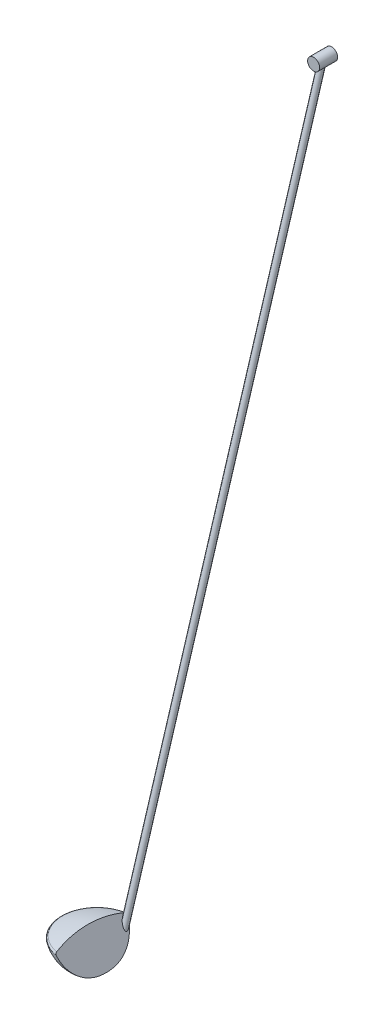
ISO-10303-21;
HEADER;
FILE_DESCRIPTION(('STEP AP214'),'2;1');
FILE_NAME('part.step','',(''),(''),'','','');
FILE_SCHEMA(('AUTOMOTIVE_DESIGN { 1 0 10303 214 1 1 1 1 }'));
ENDSEC;
DATA;
#1=APPLICATION_CONTEXT('core data for automotive mechanical design processes');
#2=APPLICATION_PROTOCOL_DEFINITION('international standard','automotive_design',2000,#1);
#3=PRODUCT_CONTEXT('',#1,'mechanical');
#4=PRODUCT('Part','Part','',(#3));
#5=PRODUCT_RELATED_PRODUCT_CATEGORY('part','',(#4));
#6=PRODUCT_DEFINITION_FORMATION('','',#4);
#7=PRODUCT_DEFINITION_CONTEXT('part definition',#1,'design');
#8=PRODUCT_DEFINITION('design','',#6,#7);
#9=PRODUCT_DEFINITION_SHAPE('','',#8);
#10=(LENGTH_UNIT() NAMED_UNIT(*) SI_UNIT(.MILLI.,.METRE.));
#11=(NAMED_UNIT(*) PLANE_ANGLE_UNIT() SI_UNIT($,.RADIAN.));
#12=(NAMED_UNIT(*) SI_UNIT($,.STERADIAN.) SOLID_ANGLE_UNIT());
#13=UNCERTAINTY_MEASURE_WITH_UNIT(LENGTH_MEASURE(1.E-05),#10,'distance_accuracy_value','');
#14=(GEOMETRIC_REPRESENTATION_CONTEXT(3) GLOBAL_UNCERTAINTY_ASSIGNED_CONTEXT((#13)) GLOBAL_UNIT_ASSIGNED_CONTEXT((#10,
#11,#12)) REPRESENTATION_CONTEXT('',''));
#15=CARTESIAN_POINT('',(0.,0.,0.));
#16=DIRECTION('',(0.,0.,1.));
#17=DIRECTION('',(1.,0.,0.));
#18=AXIS2_PLACEMENT_3D('',#15,#16,#17);
#19=CARTESIAN_POINT('',(-5.,1118.42336475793,-380.830138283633));
#20=DIRECTION('',(0.,0.956952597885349,-0.290244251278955));
#21=DIRECTION('',(0.,0.290244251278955,0.956952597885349));
#22=AXIS2_PLACEMENT_3D('',#19,#20,#21);
#23=CYLINDRICAL_SURFACE('',#22,5.00000000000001);
#24=CARTESIAN_POINT('',(-7.41467266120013,42.3527441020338,-59.0325591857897));
#25=CARTESIAN_POINT('',(-7.38127194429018,42.1760687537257,-58.9982276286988));
#26=CARTESIAN_POINT('',(-7.34883294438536,41.9994214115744,-58.9628194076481));
#27=CARTESIAN_POINT('',(-7.28645036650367,41.6461155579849,-58.8897614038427));
#28=CARTESIAN_POINT('',(-7.25650725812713,41.4694570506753,-58.8521112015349));
#29=CARTESIAN_POINT('',(-7.17114889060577,40.9385328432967,-58.735480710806));
#30=CARTESIAN_POINT('',(-7.12038670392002,40.5842489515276,-58.6530005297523));
#31=CARTESIAN_POINT('',(-7.03757318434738,39.8825550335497,-58.4797422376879));
#32=CARTESIAN_POINT('',(-7.00518963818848,39.5351403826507,-58.3891481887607));
#33=CARTESIAN_POINT('',(-6.96252974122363,38.8421450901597,-58.1982409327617));
#34=CARTESIAN_POINT('',(-6.95221805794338,38.4965624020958,-58.0979435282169));
#35=CARTESIAN_POINT('',(-6.95549698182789,37.7969640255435,-57.8843015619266));
#36=CARTESIAN_POINT('',(-6.96989528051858,37.4430509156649,-57.7706336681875));
#37=CARTESIAN_POINT('',(-7.0214504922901,36.7399804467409,-57.5339261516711));
#38=CARTESIAN_POINT('',(-7.05861748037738,36.3908252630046,-57.4108824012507));
#39=CARTESIAN_POINT('',(-7.15026736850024,35.6969254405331,-57.1559785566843));
#40=CARTESIAN_POINT('',(-7.20480282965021,35.3521975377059,-57.0240926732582));
#41=CARTESIAN_POINT('',(-7.32547573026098,34.6679837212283,-56.7524883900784));
#42=CARTESIAN_POINT('',(-7.39161254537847,34.3284975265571,-56.6127704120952));
#43=CARTESIAN_POINT('',(-7.53197479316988,33.6494381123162,-56.3238632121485));
#44=CARTESIAN_POINT('',(-7.60630115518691,33.3099312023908,-56.1745681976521));
#45=CARTESIAN_POINT('',(-7.7588463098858,32.6351797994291,-55.8685729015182));
#46=CARTESIAN_POINT('',(-7.83706502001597,32.2999352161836,-55.7118727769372));
#47=CARTESIAN_POINT('',(-7.99482713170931,31.633753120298,-55.3914622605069));
#48=CARTESIAN_POINT('',(-8.07436846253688,31.3028100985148,-55.2277622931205));
#49=CARTESIAN_POINT('',(-8.23308154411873,30.6444463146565,-54.8932751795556));
#50=CARTESIAN_POINT('',(-8.31225329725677,30.3170255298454,-54.722488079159));
#51=CARTESIAN_POINT('',(-8.53310184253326,29.397831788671,-54.2307519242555));
#52=CARTESIAN_POINT('',(-8.67269578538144,28.8098603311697,-53.901703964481));
#53=CARTESIAN_POINT('',(-8.93937397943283,27.6439947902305,-53.2210243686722));
#54=CARTESIAN_POINT('',(-9.0664545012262,27.0661037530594,-52.8693860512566));
#55=CARTESIAN_POINT('',(-9.30065325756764,25.9304276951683,-52.1507230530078));
#56=CARTESIAN_POINT('',(-9.40808352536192,25.3724678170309,-51.7840782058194));
#57=CARTESIAN_POINT('',(-9.60074487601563,24.2663818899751,-51.0307220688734));
#58=CARTESIAN_POINT('',(-9.68597610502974,23.7182557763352,-50.6440109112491));
#59=CARTESIAN_POINT('',(-9.75763822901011,23.1751241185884,-50.2477352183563));
#60=B_SPLINE_CURVE_WITH_KNOTS('',3,(#24,#25,#26,#27,#28,#29,#30,#31,#32,#33,#34,#35,#36,#37,#38,
#39,#40,#41,#42,#43,#44,#45,#46,#47,#48,#49,#50,#51,#52,#53,#54,#55,#56,#57,#58,#59),
.UNSPECIFIED.,.F.,.F.,(4,2,2,2,2,2,2,2,2,2,2,2,2,2,2,2,2,4),(0.,0.5491478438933,
1.09839877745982,2.19979394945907,3.28058835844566,4.35965134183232,5.47466075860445,
6.59016391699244,7.70907545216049,8.82792678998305,9.96255905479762,11.0971672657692,
12.2301409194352,13.363107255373,15.4268173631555,17.4911406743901,19.5191237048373,
21.5470933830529),.UNSPECIFIED.);
#61=CARTESIAN_POINT('',(-7.01920211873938,39.6576146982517,-58.4198006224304));
#62=VERTEX_POINT('',#61);
#63=CARTESIAN_POINT('',(-9.62735363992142,24.0767950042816,-50.8935188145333));
#64=VERTEX_POINT('',#63);
#65=EDGE_CURVE('E60',#62,#64,#60,.T.);
#66=ORIENTED_EDGE('',*,*,#65,.F.);
#67=CARTESIAN_POINT('',(-5.,36.1602540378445,-52.5791392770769));
#68=DIRECTION('',(0.866025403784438,0.500000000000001,0.));
#69=DIRECTION('',(-0.471896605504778,0.817348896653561,-0.330536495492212));
#70=AXIS2_PLACEMENT_3D('',#67,#68,#69);
#71=ELLIPSE('',#70,10.4498383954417,5.00000000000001);
#72=CARTESIAN_POINT('',(-3.11251394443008,32.8910322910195,-56.4259137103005));
#73=VERTEX_POINT('',#72);
#74=EDGE_CURVE('E90',#73,#62,#71,.F.);
#75=ORIENTED_EDGE('',*,*,#74,.F.);
#76=CARTESIAN_POINT('',(-0.631505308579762,23.1751241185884,-51.182493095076));
#77=CARTESIAN_POINT('',(-0.769860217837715,23.8489611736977,-51.646506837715));
#78=CARTESIAN_POINT('',(-0.925101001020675,24.5312063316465,-52.0928061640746));
#79=CARTESIAN_POINT('',(-1.25993092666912,25.9115454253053,-52.9496875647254));
#80=CARTESIAN_POINT('',(-1.43950845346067,26.609631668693,-53.3602865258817));
#81=CARTESIAN_POINT('',(-1.72252101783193,27.6772327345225,-53.9544253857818));
#82=CARTESIAN_POINT('',(-1.82039862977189,28.0410245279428,-54.1510766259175));
#83=CARTESIAN_POINT('',(-2.01875672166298,28.7727538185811,-54.5351319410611));
#84=CARTESIAN_POINT('',(-2.11923711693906,29.1406911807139,-54.7225363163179));
#85=CARTESIAN_POINT('',(-2.32124655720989,29.8807874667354,-55.0881979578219));
#86=CARTESIAN_POINT('',(-2.4227755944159,30.2529463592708,-55.2664552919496));
#87=CARTESIAN_POINT('',(-2.62498952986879,31.0016585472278,-55.6139890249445));
#88=CARTESIAN_POINT('',(-2.72567444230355,31.3782117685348,-55.7832655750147));
#89=CARTESIAN_POINT('',(-2.89571687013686,32.0289733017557,-56.0665041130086));
#90=CARTESIAN_POINT('',(-2.96589026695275,32.3020478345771,-56.1825849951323));
#91=CARTESIAN_POINT('',(-3.10326663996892,32.8507523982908,-56.4103756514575));
#92=CARTESIAN_POINT('',(-3.17046969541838,33.1263823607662,-56.5220855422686));
#93=CARTESIAN_POINT('',(-3.3003545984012,33.6805389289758,-56.7413565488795));
#94=CARTESIAN_POINT('',(-3.36303391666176,33.9590670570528,-56.8489153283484));
#95=CARTESIAN_POINT('',(-3.48174975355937,34.5190735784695,-57.0600148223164));
#96=CARTESIAN_POINT('',(-3.53778609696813,34.8005520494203,-57.1635554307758));
#97=CARTESIAN_POINT('',(-3.6399121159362,35.3630422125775,-57.3655481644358));
#98=CARTESIAN_POINT('',(-3.68611788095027,35.6440153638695,-57.4640478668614));
#99=CARTESIAN_POINT('',(-3.76643057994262,36.2089263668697,-57.6574972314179));
#100=CARTESIAN_POINT('',(-3.80053807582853,36.4928640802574,-57.7524470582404));
#101=CARTESIAN_POINT('',(-3.85357289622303,37.0628570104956,-57.9387044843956));
#102=CARTESIAN_POINT('',(-3.87252554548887,37.3489078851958,-58.0300179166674));
#103=CARTESIAN_POINT('',(-3.89325228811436,37.9227301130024,-58.2090248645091));
#104=CARTESIAN_POINT('',(-3.89502912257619,38.210501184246,-58.2967189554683));
#105=CARTESIAN_POINT('',(-3.88044854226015,38.8172248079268,-58.4772644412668));
#106=CARTESIAN_POINT('',(-3.86215537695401,39.1362595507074,-58.5696818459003));
#107=CARTESIAN_POINT('',(-3.80677933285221,39.7744439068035,-58.7493645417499));
#108=CARTESIAN_POINT('',(-3.76967640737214,40.0935932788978,-58.8366242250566));
#109=CARTESIAN_POINT('',(-3.68001209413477,40.7367170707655,-59.0069739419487));
#110=CARTESIAN_POINT('',(-3.62719762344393,41.0606808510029,-59.0899673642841));
#111=CARTESIAN_POINT('',(-3.53981579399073,41.5458778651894,-59.2098528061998));
#112=CARTESIAN_POINT('',(-3.50936406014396,41.707319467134,-59.2490091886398));
#113=CARTESIAN_POINT('',(-3.44617463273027,42.0300947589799,-59.3258032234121));
#114=CARTESIAN_POINT('',(-3.41343723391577,42.1914284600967,-59.3634410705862));
#115=CARTESIAN_POINT('',(-3.37977439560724,42.3527441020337,-59.4003159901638));
#116=B_SPLINE_CURVE_WITH_KNOTS('',3,(#76,#77,#78,#79,#80,#81,#82,#83,#84,#85,#86,#87,#88,#89,
#90,#91,#92,#93,#94,#95,#96,#97,#98,#99,#100,#101,#102,#103,#104,#105,#106,#107,#108,#109,#110,
#111,#112,#113,#114,#115),.UNSPECIFIED.,.F.,.F.,(4,2,2,2,2,2,2,2,2,2,2,2,2,2,2,2,2,2,2,4),(0.,
2.48855786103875,4.97593211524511,6.25073234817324,7.52549116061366,8.80024051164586,
10.0749683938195,10.9896443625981,11.9042959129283,12.8194549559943,13.7346381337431,
14.6383266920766,15.5419732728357,16.4441066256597,17.3460960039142,18.3433822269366,
19.3417335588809,20.3571280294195,20.8637822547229,21.3703712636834),.UNSPECIFIED.);
#117=CARTESIAN_POINT('',(-0.77503164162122,23.8504666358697,-51.6397369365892));
#118=VERTEX_POINT('',#117);
#119=EDGE_CURVE('E86',#118,#73,#116,.T.);
#120=ORIENTED_EDGE('',*,*,#119,.F.);
#121=CARTESIAN_POINT('',(-5.,24.6265453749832,-49.0809590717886));
#122=DIRECTION('',(0.,0.956952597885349,-0.290244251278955));
#123=DIRECTION('',(0.,0.290244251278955,0.956952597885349));
#124=AXIS2_PLACEMENT_3D('',#121,#122,#123);
#125=CIRCLE('',#124,4.99999999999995);
#126=EDGE_CURVE('E89',#118,#64,#125,.T.);
#127=ORIENTED_EDGE('',*,*,#126,.T.);
#128=EDGE_LOOP('',(#66,#75,#120,#127));
#129=FACE_BOUND('',#128,.T.);
#130=CARTESIAN_POINT('',(-5.,1105.5,-371.68555541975));
#131=CARTESIAN_POINT('',(-4.88037812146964,1105.49999854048,-371.685552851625));
#132=CARTESIAN_POINT('',(-4.76077656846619,1105.50215114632,-371.69069959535));
#133=CARTESIAN_POINT('',(-4.52255936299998,1105.51069316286,-371.711177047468));
#134=CARTESIAN_POINT('',(-4.40394401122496,1105.51708382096,-371.726510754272));
#135=CARTESIAN_POINT('',(-4.168620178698,1105.53392053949,-371.767079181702));
#136=CARTESIAN_POINT('',(-4.05191336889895,1105.54436997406,-371.792322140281));
#137=CARTESIAN_POINT('',(-3.82131072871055,1105.5690309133,-371.852250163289));
#138=CARTESIAN_POINT('',(-3.70741620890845,1105.5832441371,-371.88693954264));
#139=CARTESIAN_POINT('',(-3.48400258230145,1105.61494099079,-371.964894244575));
#140=CARTESIAN_POINT('',(-3.37445816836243,1105.63240070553,-372.008096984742));
#141=CARTESIAN_POINT('',(-3.15942430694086,1105.6702383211,-372.102603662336));
#142=CARTESIAN_POINT('',(-3.05393634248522,1105.69061727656,-372.153910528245));
#143=CARTESIAN_POINT('',(-2.74426111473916,1105.75545941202,-372.318990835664));
#144=CARTESIAN_POINT('',(-2.5467555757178,1105.80364373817,-372.443962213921));
#145=CARTESIAN_POINT('',(-2.1046998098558,1105.92466858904,-372.767965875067));
#146=CARTESIAN_POINT('',(-1.86857082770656,1106.00016572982,-372.977503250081));
#147=CARTESIAN_POINT('',(-1.54369775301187,1106.11558492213,-373.318540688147));
#148=CARTESIAN_POINT('',(-1.44018337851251,1106.15446980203,-373.436838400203));
#149=CARTESIAN_POINT('',(-1.24304388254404,1106.23196426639,-373.681472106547));
#150=CARTESIAN_POINT('',(-1.14941798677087,1106.27057387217,-373.807807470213));
#151=CARTESIAN_POINT('',(-0.881347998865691,1106.38546009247,-374.200993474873));
#152=CARTESIAN_POINT('',(-0.722319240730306,1106.45982287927,-374.479260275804));
#153=CARTESIAN_POINT('',(-0.516706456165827,1106.56098969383,-374.914064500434));
#154=CARTESIAN_POINT('',(-0.453656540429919,1106.59298281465,-375.061902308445));
#155=CARTESIAN_POINT('',(-0.338948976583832,1106.65247165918,-375.362797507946));
#156=CARTESIAN_POINT('',(-0.287290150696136,1106.67996784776,-375.515854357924));
#157=CARTESIAN_POINT('',(-0.162103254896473,1106.74768072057,-375.941835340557));
#158=CARTESIAN_POINT('',(-0.100753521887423,1106.78221614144,-376.21950420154));
#159=CARTESIAN_POINT('',(-0.0393031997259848,1106.81714523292,-376.641526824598));
#160=CARTESIAN_POINT('',(-0.0239154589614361,1106.82597597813,-376.783141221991));
#161=CARTESIAN_POINT('',(-0.00385791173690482,1106.83751064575,-377.067362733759));
#162=CARTESIAN_POINT('',(0.000816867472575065,1106.84021741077,-377.209969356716));
#163=CARTESIAN_POINT('',(-0.00105791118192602,1106.83913535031,-377.496193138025));
#164=CARTESIAN_POINT('',(-0.00769441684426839,1106.83529620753,-377.639809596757));
#165=CARTESIAN_POINT('',(-0.0327526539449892,1106.82090647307,-377.925687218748));
#166=CARTESIAN_POINT('',(-0.0511744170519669,1106.81035586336,-378.067948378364));
#167=CARTESIAN_POINT('',(-0.100010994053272,1106.78272450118,-378.349705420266));
#168=CARTESIAN_POINT('',(-0.130421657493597,1106.76564600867,-378.489202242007));
#169=CARTESIAN_POINT('',(-0.203234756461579,1106.72544763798,-378.764129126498));
#170=CARTESIAN_POINT('',(-0.245636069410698,1106.70232832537,-378.899559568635));
#171=CARTESIAN_POINT('',(-0.336392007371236,1106.65392348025,-379.149130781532));
#172=CARTESIAN_POINT('',(-0.383417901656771,1106.62923260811,-379.263873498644));
#173=CARTESIAN_POINT('',(-0.486318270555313,1106.57643451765,-379.488550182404));
#174=CARTESIAN_POINT('',(-0.542195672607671,1106.54832616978,-379.598482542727));
#175=CARTESIAN_POINT('',(-0.662410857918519,1106.48946200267,-379.812835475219));
#176=CARTESIAN_POINT('',(-0.72674682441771,1106.45870675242,-379.917257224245));
#177=CARTESIAN_POINT('',(-0.863486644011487,1106.39533427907,-380.120132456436));
#178=CARTESIAN_POINT('',(-0.935893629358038,1106.36271633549,-380.218583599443));
#179=CARTESIAN_POINT('',(-1.08993241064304,1106.29573104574,-380.411100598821));
#180=CARTESIAN_POINT('',(-1.17172882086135,1106.26134117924,-380.505027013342));
#181=CARTESIAN_POINT('',(-1.34271576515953,1106.1923260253,-380.68581651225));
#182=CARTESIAN_POINT('',(-1.43190893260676,1106.15770065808,-380.772677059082));
#183=CARTESIAN_POINT('',(-1.70975875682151,1106.0547267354,-381.022146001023));
#184=CARTESIAN_POINT('',(-1.90879468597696,1105.98723130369,-381.173776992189));
#185=CARTESIAN_POINT('',(-2.34587098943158,1105.85574868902,-381.455869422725));
#186=CARTESIAN_POINT('',(-2.58573288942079,1105.79242895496,-381.5838109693));
#187=CARTESIAN_POINT('',(-3.08579754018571,1105.68157936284,-381.80109412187));
#188=CARTESIAN_POINT('',(-3.34600195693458,1105.63405079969,-381.890432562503));
#189=CARTESIAN_POINT('',(-3.88331491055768,1105.55879577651,-382.029737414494));
#190=CARTESIAN_POINT('',(-4.16060276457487,1105.53134219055,-382.0791621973));
#191=CARTESIAN_POINT('',(-4.7207571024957,1105.49996620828,-382.135533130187));
#192=CARTESIAN_POINT('',(-5.00362280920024,1105.49604055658,-382.142485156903));
#193=CARTESIAN_POINT('',(-5.56028662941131,1105.51190996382,-382.114087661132));
#194=CARTESIAN_POINT('',(-5.83414753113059,1105.53118652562,-382.079662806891));
#195=CARTESIAN_POINT('',(-6.37141637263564,1105.590798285,-381.970787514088));
#196=CARTESIAN_POINT('',(-6.63482381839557,1105.63113447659,-381.896335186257));
#197=CARTESIAN_POINT('',(-7.14529485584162,1105.72934655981,-381.708416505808));
#198=CARTESIAN_POINT('',(-7.39227182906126,1105.78730761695,-381.594760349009));
#199=CARTESIAN_POINT('',(-7.86226605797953,1105.91528759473,-381.330240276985));
#200=CARTESIAN_POINT('',(-8.08527599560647,1105.98531018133,-381.179365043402));
#201=CARTESIAN_POINT('',(-8.39936282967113,1106.0948367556,-380.9253283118));
#202=CARTESIAN_POINT('',(-8.50163191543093,1106.13252191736,-380.834908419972));
#203=CARTESIAN_POINT('',(-8.69763943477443,1106.20815086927,-380.645374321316));
#204=CARTESIAN_POINT('',(-8.79138136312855,1106.24609454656,-380.546263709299));
#205=CARTESIAN_POINT('',(-8.96965123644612,1106.32115272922,-380.339761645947));
#206=CARTESIAN_POINT('',(-9.05417784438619,1106.35826711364,-380.232368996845));
#207=CARTESIAN_POINT('',(-9.21330231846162,1106.43050635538,-380.009907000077));
#208=CARTESIAN_POINT('',(-9.28790503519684,1106.46563217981,-379.894841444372));
#209=CARTESIAN_POINT('',(-9.42418685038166,1106.53160520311,-379.661824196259));
#210=CARTESIAN_POINT('',(-9.48622617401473,1106.5625589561,-379.544113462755));
#211=CARTESIAN_POINT('',(-9.6000259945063,1106.62059447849,-379.302970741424));
#212=CARTESIAN_POINT('',(-9.65179123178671,1106.64767803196,-379.179541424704));
#213=CARTESIAN_POINT('',(-9.7446984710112,1106.69712496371,-378.92789606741));
#214=CARTESIAN_POINT('',(-9.7858452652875,1106.71949047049,-378.799682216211));
#215=CARTESIAN_POINT('',(-9.85734137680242,1106.75883862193,-378.539480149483));
#216=CARTESIAN_POINT('',(-9.88769132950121,1106.77582158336,-378.407492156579));
#217=CARTESIAN_POINT('',(-9.93563927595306,1106.8028644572,-378.151197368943));
#218=CARTESIAN_POINT('',(-9.954042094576,1106.81335828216,-378.027086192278));
#219=CARTESIAN_POINT('',(-9.98176361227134,1106.82922932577,-377.777517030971));
#220=CARTESIAN_POINT('',(-9.99107934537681,1106.83460487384,-377.652058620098));
#221=CARTESIAN_POINT('',(-10.0056897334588,1106.84301621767,-377.275027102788));
#222=CARTESIAN_POINT('',(-9.99767714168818,1106.83835379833,-377.022634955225));
#223=CARTESIAN_POINT('',(-9.94795281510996,1106.80986132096,-376.513264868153));
#224=CARTESIAN_POINT('',(-9.90502436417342,1106.78533934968,-376.256454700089));
#225=CARTESIAN_POINT('',(-9.78734987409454,1106.72015060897,-375.752416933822));
#226=CARTESIAN_POINT('',(-9.71259171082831,1106.67947768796,-375.505193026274));
#227=CARTESIAN_POINT('',(-9.51800968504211,1106.57802176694,-374.980623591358));
#228=CARTESIAN_POINT('',(-9.39250504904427,1106.51493943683,-374.705837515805));
#229=CARTESIAN_POINT('',(-9.10380880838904,1106.37946334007,-374.17868060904));
#230=CARTESIAN_POINT('',(-8.9405569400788,1106.30705476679,-373.926346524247));
#231=CARTESIAN_POINT('',(-8.65546114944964,1106.19139223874,-373.551523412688));
#232=CARTESIAN_POINT('',(-8.54562614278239,1106.14886629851,-373.419532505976));
#233=CARTESIAN_POINT('',(-8.31423071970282,1106.06437336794,-373.165933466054));
#234=CARTESIAN_POINT('',(-8.19266759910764,1106.02240650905,-373.044327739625));
#235=CARTESIAN_POINT('',(-7.93827491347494,1105.94048383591,-372.813192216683));
#236=CARTESIAN_POINT('',(-7.80546447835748,1105.90052478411,-372.703642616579));
#237=CARTESIAN_POINT('',(-7.52892228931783,1105.8239903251,-372.49817428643));
#238=CARTESIAN_POINT('',(-7.38519680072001,1105.78741300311,-372.402247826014));
#239=CARTESIAN_POINT('',(-7.03334756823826,1105.70670541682,-372.193949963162));
#240=CARTESIAN_POINT('',(-6.82071722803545,1105.66462046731,-372.088157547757));
#241=CARTESIAN_POINT('',(-6.49031473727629,1105.61104371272,-371.955245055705));
#242=CARTESIAN_POINT('',(-6.37834314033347,1105.59478361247,-371.915253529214));
#243=CARTESIAN_POINT('',(-6.15110712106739,1105.56581414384,-371.844388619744));
#244=CARTESIAN_POINT('',(-6.03584361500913,1105.55310379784,-371.813512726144));
#245=CARTESIAN_POINT('',(-5.76898961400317,1105.52846964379,-371.75388381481));
#246=CARTESIAN_POINT('',(-5.61654813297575,1105.51784024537,-371.728336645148));
#247=CARTESIAN_POINT('',(-5.30939349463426,1105.50360545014,-371.694171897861));
#248=CARTESIAN_POINT('',(-5.15467975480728,1105.50000188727,-371.685558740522));
#249=CARTESIAN_POINT('',(-5.,1105.5,-371.68555541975));
#250=B_SPLINE_CURVE_WITH_KNOTS('',3,(#130,#131,#132,#133,#134,#135,#136,#137,#138,#139,#140,
#141,#142,#143,#144,#145,#146,#147,#148,#149,#150,#151,#152,#153,#154,#155,#156,#157,#158,#159,
#160,#161,#162,#163,#164,#165,#166,#167,#168,#169,#170,#171,#172,#173,#174,#175,#176,#177,#178,
#179,#180,#181,#182,#183,#184,#185,#186,#187,#188,#189,#190,#191,#192,#193,#194,#195,#196,#197,
#198,#199,#200,#201,#202,#203,#204,#205,#206,#207,#208,#209,#210,#211,#212,#213,#214,#215,#216,
#217,#218,#219,#220,#221,#222,#223,#224,#225,#226,#227,#228,#229,#230,#231,#232,#233,#234,#235,
#236,#237,#238,#239,#240,#241,#242,#243,#244,#245,#246,#247,#248,#249),.UNSPECIFIED.,.T.,.F.,(4,
2,2,2,2,2,2,2,2,2,2,2,2,2,2,2,2,2,2,2,2,2,2,2,2,2,2,2,2,2,2,2,2,2,2,2,2,2,2,2,2,2,2,2,2,2,2,2,2,
2,2,2,2,2,2,2,2,2,2,4),(0.,0.358701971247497,0.717509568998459,1.07661609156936,
1.43588692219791,1.79260912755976,2.14946053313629,2.86282314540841,3.83119227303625,
4.31658204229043,4.80193377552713,5.78428261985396,6.27547207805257,6.76661072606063,
7.62184980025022,8.04958964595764,8.47713090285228,8.90797343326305,9.3388171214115,
9.76951178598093,10.2001661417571,10.5790417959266,10.9580430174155,11.3369629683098,
11.7160304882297,12.1032325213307,12.4905730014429,13.2647184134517,14.098313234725,
14.9319763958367,15.7767707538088,16.6214482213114,17.4475951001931,18.2737809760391,
19.104024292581,19.9345203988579,20.3589356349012,20.7831761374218,21.2074781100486,
21.631571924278,22.0408616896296,22.4499621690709,22.858877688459,23.2677691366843,
23.6450305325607,24.0224150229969,24.7766912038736,25.5584386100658,26.3404840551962,
27.2629155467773,28.1868299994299,28.7169450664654,29.2471826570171,29.7765358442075,
30.305587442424,31.025770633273,31.3854220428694,31.7449743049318,32.2086809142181,
32.6725085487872),.UNSPECIFIED.);
#251=CARTESIAN_POINT('',(-5.,1105.5,-371.68555541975));
#252=VERTEX_POINT('',#251);
#253=EDGE_CURVE('E11',#252,#252,#250,.T.);
#254=ORIENTED_EDGE('',*,*,#253,.F.);
#255=EDGE_LOOP('',(#254));
#256=FACE_BOUND('',#255,.T.);
#257=ADVANCED_FACE('F39',(#129,#256),#23,.T.);
#258=CARTESIAN_POINT('',(0.,53.7111111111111,0.));
#259=DIRECTION('',(0.,-1.,0.));
#260=DIRECTION('',(0.,0.,-1.));
#261=AXIS2_PLACEMENT_3D('',#258,#259,#260);
#262=DEGENERATE_TOROIDAL_SURFACE('',#261,7.,53.7111111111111,.T.);
#263=CARTESIAN_POINT('',(0.,0.,0.));
#264=DIRECTION('',(0.,-1.,0.));
#265=DIRECTION('',(0.,0.,-1.));
#266=AXIS2_PLACEMENT_3D('',#263,#264,#265);
#267=CIRCLE('',#266,7.);
#268=CARTESIAN_POINT('',(0.,0.,-7.));
#269=VERTEX_POINT('',#268);
#270=EDGE_CURVE('E145',#269,#269,#267,.T.);
#271=ORIENTED_EDGE('',*,*,#270,.F.);
#272=EDGE_LOOP('',(#271));
#273=FACE_BOUND('',#272,.T.);
#274=CARTESIAN_POINT('',(-8.57523580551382,42.3527441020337,-58.875170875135));
#275=CARTESIAN_POINT('',(-8.20103007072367,41.7046007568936,-58.7879688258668));
#276=CARTESIAN_POINT('',(-7.82774566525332,41.0580532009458,-58.6850042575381));
#277=CARTESIAN_POINT('',(-7.08367388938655,39.7692830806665,-58.4477476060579));
#278=CARTESIAN_POINT('',(-6.71288652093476,39.1270605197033,-58.3134554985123));
#279=CARTESIAN_POINT('',(-5.97447477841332,37.8480938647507,-58.0137458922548));
#280=CARTESIAN_POINT('',(-5.60685031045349,37.2113496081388,-57.8483293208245));
#281=CARTESIAN_POINT('',(-4.87543927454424,35.9445085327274,-57.4866692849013));
#282=CARTESIAN_POINT('',(-4.51165269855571,35.3144117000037,-57.290425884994));
#283=CARTESIAN_POINT('',(-3.42815220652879,33.4377337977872,-56.6565729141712));
#284=CARTESIAN_POINT('',(-2.71496597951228,32.2024590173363,-56.173299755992));
#285=CARTESIAN_POINT('',(-1.31159137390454,29.7717428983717,-55.0883964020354));
#286=CARTESIAN_POINT('',(-0.621402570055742,28.5763008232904,-54.4867683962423));
#287=CARTESIAN_POINT('',(0.731604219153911,26.2328243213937,-53.1689056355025));
#288=CARTESIAN_POINT('',(1.39440541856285,25.0848189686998,-52.452601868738));
#289=CARTESIAN_POINT('',(2.68744121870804,22.8452152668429,-50.9107449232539));
#290=CARTESIAN_POINT('',(3.31767545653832,21.7536175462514,-50.0851905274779));
#291=CARTESIAN_POINT('',(4.54143672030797,19.6340008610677,-48.3302804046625));
#292=CARTESIAN_POINT('',(5.13494345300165,18.606017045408,-47.4008680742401));
#293=CARTESIAN_POINT('',(6.2806900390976,16.6215257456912,-45.4453224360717));
#294=CARTESIAN_POINT('',(6.83292994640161,15.6650181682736,-44.4191892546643));
#295=CARTESIAN_POINT('',(7.89215734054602,13.8303825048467,-42.2779973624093));
#296=CARTESIAN_POINT('',(8.39915613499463,12.9522348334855,-41.1629610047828));
#297=CARTESIAN_POINT('',(9.36468882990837,11.279883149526,-38.8516890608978));
#298=CARTESIAN_POINT('',(9.82322340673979,10.4856779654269,-37.6554546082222));
#299=CARTESIAN_POINT('',(10.4719478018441,9.36205435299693,-35.8083273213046));
#300=CARTESIAN_POINT('',(10.6815300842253,8.99904719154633,-35.1843226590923));
#301=CARTESIAN_POINT('',(11.0875665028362,8.295771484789,-33.9194767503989));
#302=CARTESIAN_POINT('',(11.2840218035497,7.95550092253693,-33.2786370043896));
#303=CARTESIAN_POINT('',(11.6635473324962,7.29814342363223,-31.9812169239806));
#304=CARTESIAN_POINT('',(11.8466160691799,6.98105907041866,-31.3246348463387));
#305=CARTESIAN_POINT('',(12.1991013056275,6.37053673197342,-29.9970431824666));
#306=CARTESIAN_POINT('',(12.3685189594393,6.07709674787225,-29.3260348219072));
#307=CARTESIAN_POINT('',(12.6952018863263,5.51126532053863,-27.9638026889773));
#308=CARTESIAN_POINT('',(12.8523244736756,5.23912101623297,-27.2724420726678));
#309=CARTESIAN_POINT('',(13.1523167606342,4.71951913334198,-25.8775316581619));
#310=CARTESIAN_POINT('',(13.2951876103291,4.47205956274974,-25.1739828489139));
#311=CARTESIAN_POINT('',(13.5666224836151,4.00192057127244,-23.7559444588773));
#312=CARTESIAN_POINT('',(13.6951866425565,3.7792409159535,-23.0414549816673));
#313=CARTESIAN_POINT('',(13.9380117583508,3.35865547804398,-21.6028840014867));
#314=CARTESIAN_POINT('',(14.0522737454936,3.160747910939,-20.8788031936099));
#315=CARTESIAN_POINT('',(14.2670002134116,2.78883075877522,-19.4196330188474));
#316=CARTESIAN_POINT('',(14.3674126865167,2.61491125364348,-18.6845130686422));
#317=CARTESIAN_POINT('',(14.5541574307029,2.29145986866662,-17.2071701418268));
#318=CARTESIAN_POINT('',(14.6404897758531,2.14192786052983,-16.4649472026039));
#319=CARTESIAN_POINT('',(14.799419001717,1.86665436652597,-14.974630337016));
#320=CARTESIAN_POINT('',(14.8720154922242,1.74091355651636,-14.2265362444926));
#321=CARTESIAN_POINT('',(15.0039625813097,1.51237449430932,-12.72567846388));
#322=CARTESIAN_POINT('',(15.0633125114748,1.40957739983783,-11.9729145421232));
#323=CARTESIAN_POINT('',(15.1966932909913,1.17855511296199,-10.0754098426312));
#324=CARTESIAN_POINT('',(15.2625555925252,1.06447826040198,-8.92835489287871));
#325=CARTESIAN_POINT('',(15.3680941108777,0.881680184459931,-6.62935839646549));
#326=CARTESIAN_POINT('',(15.4077662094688,0.812966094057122,-5.47741610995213));
#327=CARTESIAN_POINT('',(15.449738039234,0.740268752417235,-3.74728302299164));
#328=CARTESIAN_POINT('',(15.4608072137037,0.721096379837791,-3.1698763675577));
#329=CARTESIAN_POINT('',(15.4773280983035,0.692481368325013,-2.01473469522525));
#330=CARTESIAN_POINT('',(15.4827798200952,0.683038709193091,-1.43699967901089));
#331=CARTESIAN_POINT('',(15.4882080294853,0.673636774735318,-0.281445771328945));
#332=CARTESIAN_POINT('',(15.4881846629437,0.673677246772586,0.29637311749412));
#333=CARTESIAN_POINT('',(15.4826618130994,0.683243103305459,1.45190711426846));
#334=CARTESIAN_POINT('',(15.4771623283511,0.692768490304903,2.0296222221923));
#335=CARTESIAN_POINT('',(15.4605572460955,0.721529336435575,3.18397749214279));
#336=CARTESIAN_POINT('',(15.4494590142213,0.740752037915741,3.76061806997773));
#337=CARTESIAN_POINT('',(15.4214050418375,0.789342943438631,4.9133304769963));
#338=CARTESIAN_POINT('',(15.40444919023,0.818711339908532,5.48940229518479));
#339=CARTESIAN_POINT('',(15.3443011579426,0.922890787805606,7.21632328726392));
#340=CARTESIAN_POINT('',(15.2918273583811,1.01377807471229,8.36596387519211));
#341=CARTESIAN_POINT('',(15.1593216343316,1.24328472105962,10.6573585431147));
#342=CARTESIAN_POINT('',(15.0793267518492,1.38183992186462,11.7991211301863));
#343=CARTESIAN_POINT('',(14.8892955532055,1.71098361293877,14.0726038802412));
#344=CARTESIAN_POINT('',(14.779262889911,1.90156577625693,15.2043252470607));
#345=CARTESIAN_POINT('',(14.5674811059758,2.26838258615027,17.0964410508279));
#346=CARTESIAN_POINT('',(14.4741924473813,2.42996328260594,17.8606556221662));
#347=CARTESIAN_POINT('',(14.2725324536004,2.77924863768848,19.3810758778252));
#348=CARTESIAN_POINT('',(14.1641618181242,2.96695208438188,20.1372819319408));
#349=CARTESIAN_POINT('',(13.9321120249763,3.36887411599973,21.6404416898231));
#350=CARTESIAN_POINT('',(13.8084292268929,3.58309900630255,22.3873931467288));
#351=CARTESIAN_POINT('',(13.545698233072,4.03816243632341,23.8704267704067));
#352=CARTESIAN_POINT('',(13.4066498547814,4.27900129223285,24.6065088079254));
#353=CARTESIAN_POINT('',(13.1135037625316,4.78674521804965,26.0648962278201));
#354=CARTESIAN_POINT('',(12.9594364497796,5.05359763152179,26.7872260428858));
#355=CARTESIAN_POINT('',(12.6361149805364,5.61360684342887,28.2182423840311));
#356=CARTESIAN_POINT('',(12.4668594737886,5.9067659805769,28.9269276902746));
#357=CARTESIAN_POINT('',(12.1133763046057,6.51901678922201,30.3290826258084));
#358=CARTESIAN_POINT('',(11.9291507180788,6.8381048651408,31.0225543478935));
#359=CARTESIAN_POINT('',(11.5459290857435,7.50186420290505,32.3930657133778));
#360=CARTESIAN_POINT('',(11.3469316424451,7.84653788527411,33.0701037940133));
#361=CARTESIAN_POINT('',(10.933912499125,8.56190802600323,34.4081532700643));
#362=CARTESIAN_POINT('',(10.7198512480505,8.93267298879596,35.0691158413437));
#363=CARTESIAN_POINT('',(10.2775124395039,9.6988262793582,36.3718277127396));
#364=CARTESIAN_POINT('',(10.0492334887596,10.0942170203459,37.013575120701));
#365=CARTESIAN_POINT('',(9.57888098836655,10.9088914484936,38.2764639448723));
#366=CARTESIAN_POINT('',(9.33680824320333,11.328173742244,38.8976065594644));
#367=CARTESIAN_POINT('',(8.83926027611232,12.1899521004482,40.1181399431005));
#368=CARTESIAN_POINT('',(8.58378372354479,12.6324504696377,40.7175285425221));
#369=CARTESIAN_POINT('',(8.05962059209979,13.5403276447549,41.8939498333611));
#370=CARTESIAN_POINT('',(7.79091949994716,14.0057315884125,42.4709566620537));
#371=CARTESIAN_POINT('',(7.24104647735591,14.958139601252,43.6008023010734));
#372=CARTESIAN_POINT('',(6.95987326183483,15.445145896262,44.1536386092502));
#373=CARTESIAN_POINT('',(6.38564832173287,16.4397326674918,45.2339040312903));
#374=CARTESIAN_POINT('',(6.09259838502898,16.9473100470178,45.7613369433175));
#375=CARTESIAN_POINT('',(5.49514146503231,17.9821357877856,46.7898442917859));
#376=CARTESIAN_POINT('',(5.1907334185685,18.5093859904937,47.2909162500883));
#377=CARTESIAN_POINT('',(4.28558747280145,20.0771447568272,48.7149062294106));
#378=CARTESIAN_POINT('',(3.67024086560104,21.1429563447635,49.601125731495));
#379=CARTESIAN_POINT('',(2.40421173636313,23.3357831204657,51.265839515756));
#380=CARTESIAN_POINT('',(1.75352780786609,24.4628007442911,52.0443295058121));
#381=CARTESIAN_POINT('',(0.422177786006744,26.7687666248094,53.4872953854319));
#382=CARTESIAN_POINT('',(-0.258455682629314,27.9476583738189,54.1518916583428));
#383=CARTESIAN_POINT('',(-1.64532846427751,30.3497924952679,55.3631834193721));
#384=CARTESIAN_POINT('',(-2.35156107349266,31.5730232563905,55.9099095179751));
#385=CARTESIAN_POINT('',(-3.51460247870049,33.5874700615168,56.6987054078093));
#386=CARTESIAN_POINT('',(-3.96519901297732,34.3679261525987,56.9779747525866));
#387=CARTESIAN_POINT('',(-4.87312578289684,35.9405014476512,57.4885569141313));
#388=CARTESIAN_POINT('',(-5.33045546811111,36.7326196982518,57.71987362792));
#389=CARTESIAN_POINT('',(-6.24999366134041,38.325306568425,58.1336725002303));
#390=CARTESIAN_POINT('',(-6.71219532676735,39.1258633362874,58.3162155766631));
#391=CARTESIAN_POINT('',(-7.64086246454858,40.7343620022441,58.6324577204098));
#392=CARTESIAN_POINT('',(-8.10732885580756,41.5423054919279,58.7661459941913));
#393=CARTESIAN_POINT('',(-8.57523580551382,42.3527441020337,58.875170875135));
#394=B_SPLINE_CURVE_WITH_KNOTS('',3,(#274,#275,#276,#277,#278,#279,#280,#281,#282,#283,#284,
#285,#286,#287,#288,#289,#290,#291,#292,#293,#294,#295,#296,#297,#298,#299,#300,#301,#302,#303,
#304,#305,#306,#307,#308,#309,#310,#311,#312,#313,#314,#315,#316,#317,#318,#319,#320,#321,#322,
#323,#324,#325,#326,#327,#328,#329,#330,#331,#332,#333,#334,#335,#336,#337,#338,#339,#340,#341,
#342,#343,#344,#345,#346,#347,#348,#349,#350,#351,#352,#353,#354,#355,#356,#357,#358,#359,#360,
#361,#362,#363,#364,#365,#366,#367,#368,#369,#370,#371,#372,#373,#374,#375,#376,#377,#378,#379,
#380,#381,#382,#383,#384,#385,#386,#387,#388,#389,#390,#391,#392,#393),.UNSPECIFIED.,.F.,.F.,(4,
2,2,2,2,2,2,2,2,2,2,2,2,2,2,2,2,2,2,2,2,2,2,2,2,2,2,2,2,2,2,2,2,2,2,2,2,2,2,2,2,2,2,2,2,2,2,2,2,
2,2,2,2,2,2,2,2,2,2,4),(0.,2.26024492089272,4.52049160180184,6.78067095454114,9.04084557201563,
13.5530683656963,18.0652076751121,22.5800726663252,27.0949879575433,31.6123760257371,
36.1297581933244,40.6460081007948,45.1621949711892,47.4168215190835,49.6712477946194,
51.9259248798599,54.180411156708,56.4580527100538,58.7355103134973,61.0129463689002,
63.2902182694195,65.5758215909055,67.8614128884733,70.1470691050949,72.432840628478,
75.8952004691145,79.3581046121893,81.0915094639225,82.8249107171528,84.5582657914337,
86.2916213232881,88.022702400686,89.7538163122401,93.2157866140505,96.6731153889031,
100.130023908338,102.489447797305,104.848762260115,107.208638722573,109.56854322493,
111.923766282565,114.279198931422,116.634305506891,118.989635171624,121.35139791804,
123.713392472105,126.075249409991,128.437341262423,130.802085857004,133.167074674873,
135.531708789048,137.896564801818,142.44034459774,146.984305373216,151.523433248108,
156.061380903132,158.890626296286,161.719641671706,164.545106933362,167.371196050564),.UNSPECIFIED.);
#395=CARTESIAN_POINT('',(-8.57512033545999,42.3525441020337,-58.8751439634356));
#396=VERTEX_POINT('',#395);
#397=EDGE_CURVE('E149',#396,#62,#394,.T.);
#398=ORIENTED_EDGE('',*,*,#397,.T.);
#399=ORIENTED_EDGE('',*,*,#65,.T.);
#400=CARTESIAN_POINT('',(-10.0001999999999,24.1713795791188,-50.8851956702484));
#401=CARTESIAN_POINT('',(-9.88913383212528,24.142939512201,-50.8879366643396));
#402=CARTESIAN_POINT('',(-9.77800802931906,24.1147103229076,-50.8904378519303));
#403=CARTESIAN_POINT('',(-9.55562715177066,24.0587276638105,-50.8949993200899));
#404=CARTESIAN_POINT('',(-9.44437207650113,24.0309741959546,-50.8970595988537));
#405=CARTESIAN_POINT('',(-9.11042634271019,23.9485153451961,-50.9026366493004));
#406=CARTESIAN_POINT('',(-8.88752820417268,23.8946045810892,-50.9055502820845));
#407=CARTESIAN_POINT('',(-8.43781820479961,23.7888220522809,-50.9102909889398));
#408=CARTESIAN_POINT('',(-8.21099651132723,23.7369912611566,-50.912101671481));
#409=CARTESIAN_POINT('',(-7.75638598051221,23.637427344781,-50.9154471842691));
#410=CARTESIAN_POINT('',(-7.52859693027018,23.5896951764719,-50.9169819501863));
#411=CARTESIAN_POINT('',(-7.07909069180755,23.5019319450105,-50.9212436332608));
#412=CARTESIAN_POINT('',(-6.85741227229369,23.4617034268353,-50.9239308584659));
#413=CARTESIAN_POINT('',(-6.41261716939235,23.3905330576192,-50.932877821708));
#414=CARTESIAN_POINT('',(-6.18950102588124,23.3595879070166,-50.9391362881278));
#415=CARTESIAN_POINT('',(-5.85467348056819,23.323716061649,-50.9535763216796));
#416=CARTESIAN_POINT('',(-5.74342106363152,23.3135335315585,-50.9592038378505));
#417=CARTESIAN_POINT('',(-5.52074294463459,23.2971132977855,-50.9724663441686));
#418=CARTESIAN_POINT('',(-5.40931725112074,23.2908754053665,-50.9801012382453));
#419=CARTESIAN_POINT('',(-5.18649740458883,23.2826171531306,-50.9975460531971));
#420=CARTESIAN_POINT('',(-5.07510324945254,23.2805960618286,-51.0073555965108));
#421=CARTESIAN_POINT('',(-4.85252520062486,23.2807039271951,-51.0290858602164));
#422=CARTESIAN_POINT('',(-4.74134131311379,23.2828330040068,-51.0410066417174));
#423=CARTESIAN_POINT('',(-4.43749322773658,23.2938489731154,-51.0761669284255));
#424=CARTESIAN_POINT('',(-4.24518470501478,23.3065605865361,-51.101272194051));
#425=CARTESIAN_POINT('',(-3.86180502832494,23.3404514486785,-51.1549939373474));
#426=CARTESIAN_POINT('',(-3.67073440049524,23.3616340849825,-51.183611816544));
#427=CARTESIAN_POINT('',(-3.28835305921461,23.409907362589,-51.2426946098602));
#428=CARTESIAN_POINT('',(-3.09704892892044,23.4370356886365,-51.2731703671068));
#429=CARTESIAN_POINT('',(-2.71511368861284,23.495268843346,-51.334549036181));
#430=CARTESIAN_POINT('',(-2.52448262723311,23.5263739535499,-51.3654519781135));
#431=CARTESIAN_POINT('',(-2.13805372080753,23.5923484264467,-51.4278010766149));
#432=CARTESIAN_POINT('',(-1.94226855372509,23.6273015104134,-51.4592365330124));
#433=CARTESIAN_POINT('',(-1.55095008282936,23.6994047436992,-51.5212031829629));
#434=CARTESIAN_POINT('',(-1.3554167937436,23.736555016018,-51.5517343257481));
#435=CARTESIAN_POINT('',(-0.966492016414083,23.8121670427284,-51.6112517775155));
#436=CARTESIAN_POINT('',(-0.773099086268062,23.8506114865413,-51.6402506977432));
#437=CARTESIAN_POINT('',(-0.386402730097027,23.9288772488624,-51.696840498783));
#438=CARTESIAN_POINT('',(-0.193099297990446,23.9686984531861,-51.7244314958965));
#439=CARTESIAN_POINT('',(0.000199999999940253,24.009066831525,-51.7512236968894));
#440=B_SPLINE_CURVE_WITH_KNOTS('',3,(#400,#401,#402,#403,#404,#405,#406,#407,#408,#409,#410,
#411,#412,#413,#414,#415,#416,#417,#418,#419,#420,#421,#422,#423,#424,#425,#426,#427,#428,#429,
#430,#431,#432,#433,#434,#435,#436,#437,#438,#439),.UNSPECIFIED.,.F.,.F.,(4,2,2,2,2,2,2,2,2,2,2,
2,2,2,2,2,2,2,2,4),(0.,0.344046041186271,0.688093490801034,1.37610482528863,2.07410632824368,
2.77227035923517,3.44810855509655,4.12370625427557,4.45920853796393,4.79469476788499,
5.13012279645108,5.46556053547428,6.04827702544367,6.63122677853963,7.21798409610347,
7.80478297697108,8.40881503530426,9.01288093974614,9.61076543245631,10.2086004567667),.UNSPECIFIED.);
#441=EDGE_CURVE('E53',#64,#118,#440,.T.);
#442=ORIENTED_EDGE('',*,*,#441,.T.);
#443=ORIENTED_EDGE('',*,*,#119,.T.);
#444=CARTESIAN_POINT('',(-8.57512033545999,42.3525441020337,58.8751439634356));
#445=VERTEX_POINT('',#444);
#446=EDGE_CURVE('E155',#73,#445,#394,.T.);
#447=ORIENTED_EDGE('',*,*,#446,.T.);
#448=CARTESIAN_POINT('',(0.,42.3525441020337,0.));
#449=DIRECTION('',(0.,1.,0.));
#450=DIRECTION('',(0.,0.,1.));
#451=AXIS2_PLACEMENT_3D('',#448,#449,#450);
#452=CIRCLE('',#451,59.4963466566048);
#453=EDGE_CURVE('E143',#445,#396,#452,.F.);
#454=ORIENTED_EDGE('',*,*,#453,.T.);
#455=EDGE_LOOP('',(#398,#399,#442,#443,#447,#454));
#456=FACE_BOUND('',#455,.T.);
#457=ADVANCED_FACE('F100',(#273,#456),#262,.T.);
#458=CARTESIAN_POINT('',(0.,-130.,0.));
#459=DIRECTION('',(0.,-1.,0.));
#460=DIRECTION('',(0.,0.,-1.));
#461=AXIS2_PLACEMENT_3D('',#458,#459,#460);
#462=SPHERICAL_SURFACE('',#461,185.);
#463=CARTESIAN_POINT('',(0.,45.8384032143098,0.));
#464=DIRECTION('',(0.,-1.,0.));
#465=DIRECTION('',(0.,0.,-1.));
#466=AXIS2_PLACEMENT_3D('',#463,#464,#465);
#467=CIRCLE('',#466,57.4965734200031);
#468=CARTESIAN_POINT('',(-10.5876820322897,45.8384032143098,-56.5133342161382));
#469=VERTEX_POINT('',#468);
#470=CARTESIAN_POINT('',(-10.5876820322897,45.8384032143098,56.5133342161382));
#471=VERTEX_POINT('',#470);
#472=EDGE_CURVE('E141',#469,#471,#467,.F.);
#473=ORIENTED_EDGE('',*,*,#472,.T.);
#474=CARTESIAN_POINT('',(68.1995005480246,-90.6249999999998,0.));
#475=DIRECTION('',(0.866025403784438,0.500000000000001,0.));
#476=DIRECTION('',(-0.500000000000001,0.866025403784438,0.));
#477=AXIS2_PLACEMENT_3D('',#474,#475,#476);
#478=CIRCLE('',#477,167.402023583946);
#479=EDGE_CURVE('E68',#471,#469,#478,.F.);
#480=ORIENTED_EDGE('',*,*,#479,.T.);
#481=EDGE_LOOP('',(#473,#480));
#482=FACE_BOUND('',#481,.T.);
#483=ADVANCED_FACE('F183',(#482),#462,.T.);
#484=CARTESIAN_POINT('',(0.,42.9869696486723,0.));
#485=DIRECTION('',(0.,-1.,0.));
#486=DIRECTION('',(0.,0.,-1.));
#487=AXIS2_PLACEMENT_3D('',#484,#485,#486);
#488=TOROIDAL_SURFACE('',#487,56.5641965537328,3.);
#489=ORIENTED_EDGE('',*,*,#472,.F.);
#490=CARTESIAN_POINT('',(-10.5877975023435,45.8386032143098,-56.5126900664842));
#491=CARTESIAN_POINT('',(-10.5716731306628,45.8106749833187,-56.602665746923));
#492=CARTESIAN_POINT('',(-10.5534556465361,45.7791213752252,-56.6910614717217));
#493=CARTESIAN_POINT('',(-10.513144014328,45.7092995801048,-56.8641618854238));
#494=CARTESIAN_POINT('',(-10.4910530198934,45.6710368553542,-56.9488695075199));
#495=CARTESIAN_POINT('',(-10.4196510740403,45.5473650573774,-57.1959722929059));
#496=CARTESIAN_POINT('',(-10.3650275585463,45.4527543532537,-57.3523444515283));
#497=CARTESIAN_POINT('',(-10.2442724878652,45.2436004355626,-57.6450805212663));
#498=CARTESIAN_POINT('',(-10.1781761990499,45.1291183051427,-57.7815034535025));
#499=CARTESIAN_POINT('',(-10.0364222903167,44.8835933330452,-58.033121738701));
#500=CARTESIAN_POINT('',(-9.96075108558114,44.7525269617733,-58.148286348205));
#501=CARTESIAN_POINT('',(-9.79315383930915,44.4622400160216,-58.3669296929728));
#502=CARTESIAN_POINT('',(-9.70035529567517,44.3015082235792,-58.4677385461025));
#503=CARTESIAN_POINT('',(-9.50807009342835,43.968460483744,-58.6390875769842));
#504=CARTESIAN_POINT('',(-9.40858309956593,43.796143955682,-58.7096262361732));
#505=CARTESIAN_POINT('',(-9.18817990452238,43.4143944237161,-58.8279350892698));
#506=CARTESIAN_POINT('',(-9.06646164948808,43.2035722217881,-58.8699277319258));
#507=CARTESIAN_POINT('',(-8.88255947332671,42.8850443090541,-58.8983603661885));
#508=CARTESIAN_POINT('',(-8.82093497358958,42.7783075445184,-58.9020558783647));
#509=CARTESIAN_POINT('',(-8.69777560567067,42.5649892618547,-58.8975687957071));
#510=CARTESIAN_POINT('',(-8.63624077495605,42.4584078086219,-58.889382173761));
#511=CARTESIAN_POINT('',(-8.57500486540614,42.3523441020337,-58.8751170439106));
#512=B_SPLINE_CURVE_WITH_KNOTS('',3,(#490,#491,#492,#493,#494,#495,#496,#497,#498,#499,#500,
#501,#502,#503,#504,#505,#506,#507,#508,#509,#510,#511),.UNSPECIFIED.,.F.,.F.,(4,2,2,2,2,2,2,2,
2,2,4),(0.,0.286505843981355,0.572779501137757,1.1421831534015,1.70986653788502,
2.27836457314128,2.90925822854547,3.54018353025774,4.27658179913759,4.64600437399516,
5.01555218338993),.UNSPECIFIED.);
#513=EDGE_CURVE('E101',#469,#396,#512,.T.);
#514=ORIENTED_EDGE('',*,*,#513,.T.);
#515=ORIENTED_EDGE('',*,*,#453,.F.);
#516=CARTESIAN_POINT('',(-8.57500486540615,42.3523441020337,58.8751170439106));
#517=CARTESIAN_POINT('',(-8.63887976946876,42.4629786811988,58.8900136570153));
#518=CARTESIAN_POINT('',(-8.70311854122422,42.5742434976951,58.898274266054));
#519=CARTESIAN_POINT('',(-8.83166497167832,42.7968924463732,58.9018674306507));
#520=CARTESIAN_POINT('',(-8.89597259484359,42.9082765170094,58.8972049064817));
#521=CARTESIAN_POINT('',(-9.02384707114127,43.1297616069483,58.8753408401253));
#522=CARTESIAN_POINT('',(-9.08741561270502,43.2398655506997,58.8581785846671));
#523=CARTESIAN_POINT('',(-9.21344095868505,43.4581478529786,58.8117280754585));
#524=CARTESIAN_POINT('',(-9.27589735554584,43.5663255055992,58.7824354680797));
#525=CARTESIAN_POINT('',(-9.44293412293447,43.8556416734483,58.6870527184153));
#526=CARTESIAN_POINT('',(-9.54595145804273,44.0340729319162,58.6096013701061));
#527=CARTESIAN_POINT('',(-9.7443354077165,44.3776840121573,58.4220709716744));
#528=CARTESIAN_POINT('',(-9.83969608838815,44.542853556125,58.3119669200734));
#529=CARTESIAN_POINT('',(-10.0222558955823,44.8590564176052,58.0579119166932));
#530=CARTESIAN_POINT('',(-10.1091710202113,45.0095978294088,57.9131397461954));
#531=CARTESIAN_POINT('',(-10.2682716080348,45.2851681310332,57.594555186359));
#532=CARTESIAN_POINT('',(-10.3404930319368,45.4102593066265,57.420815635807));
#533=CARTESIAN_POINT('',(-10.441463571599,45.585145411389,57.1226080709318));
#534=CARTESIAN_POINT('',(-10.476083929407,45.6451096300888,57.0059910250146));
#535=CARTESIAN_POINT('',(-10.5378122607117,45.752026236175,56.7648987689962));
#536=CARTESIAN_POINT('',(-10.5649109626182,45.7989625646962,56.6404140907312));
#537=CARTESIAN_POINT('',(-10.5877975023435,45.8386032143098,56.5126900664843));
#538=B_SPLINE_CURVE_WITH_KNOTS('',3,(#516,#517,#518,#519,#520,#521,#522,#523,#524,#525,#526,
#527,#528,#529,#530,#531,#532,#533,#534,#535,#536,#537),.UNSPECIFIED.,.F.,.F.,(4,2,2,2,2,2,2,2,
2,2,4),(0.,0.385606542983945,0.771066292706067,1.15531973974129,1.53971121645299,
2.19691152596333,2.85461634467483,3.52978783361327,4.20328651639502,4.60918723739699,
5.01558609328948),.UNSPECIFIED.);
#539=EDGE_CURVE('E125',#445,#471,#538,.T.);
#540=ORIENTED_EDGE('',*,*,#539,.T.);
#541=EDGE_LOOP('',(#489,#514,#515,#540));
#542=FACE_BOUND('',#541,.T.);
#543=ADVANCED_FACE('F41',(#542),#488,.T.);
#544=CARTESIAN_POINT('',(0.,0.,-7.));
#545=DIRECTION('',(0.,-1.,0.));
#546=DIRECTION('',(0.,0.,-1.));
#547=AXIS2_PLACEMENT_3D('',#544,#545,#546);
#548=PLANE('',#547);
#549=ORIENTED_EDGE('',*,*,#270,.T.);
#550=EDGE_LOOP('',(#549));
#551=FACE_BOUND('',#550,.T.);
#552=ADVANCED_FACE('F121',(#551),#548,.T.);
#553=CARTESIAN_POINT('',(0.,27.5,0.));
#554=DIRECTION('',(0.866025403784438,0.500000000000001,0.));
#555=DIRECTION('',(-0.500000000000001,0.866025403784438,0.));
#556=AXIS2_PLACEMENT_3D('',#553,#554,#555);
#557=PLANE('',#556);
#558=ORIENTED_EDGE('',*,*,#446,.F.);
#559=ORIENTED_EDGE('',*,*,#74,.T.);
#560=ORIENTED_EDGE('',*,*,#397,.F.);
#561=ORIENTED_EDGE('',*,*,#513,.F.);
#562=ORIENTED_EDGE('',*,*,#479,.F.);
#563=ORIENTED_EDGE('',*,*,#539,.F.);
#564=EDGE_LOOP('',(#558,#559,#560,#561,#562,#563));
#565=FACE_BOUND('',#564,.T.);
#566=ADVANCED_FACE('F115',(#565),#557,.T.);
#567=CARTESIAN_POINT('',(-5.,23.3663104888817,-48.6987291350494));
#568=DIRECTION('',(0.,0.956952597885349,-0.290244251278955));
#569=DIRECTION('',(0.,0.290244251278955,0.956952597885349));
#570=AXIS2_PLACEMENT_3D('',#567,#568,#569);
#571=CONICAL_SURFACE('',#570,0.,1.3132602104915);
#572=ORIENTED_EDGE('',*,*,#441,.F.);
#573=ORIENTED_EDGE('',*,*,#126,.F.);
#574=EDGE_LOOP('',(#572,#573));
#575=FACE_BOUND('',#574,.T.);
#576=ADVANCED_FACE('F96',(#575),#571,.T.);
#577=CARTESIAN_POINT('',(-5.,1115.5,-365.));
#578=DIRECTION('',(0.,0.,1.));
#579=DIRECTION('',(1.,0.,0.));
#580=AXIS2_PLACEMENT_3D('',#577,#578,#579);
#581=CYLINDRICAL_SURFACE('',#580,10.);
#582=CARTESIAN_POINT('',(-5.,1115.5,-395.));
#583=DIRECTION('',(0.,0.,1.));
#584=DIRECTION('',(1.,0.,0.));
#585=AXIS2_PLACEMENT_3D('',#582,#583,#584);
#586=CIRCLE('',#585,10.);
#587=CARTESIAN_POINT('',(5.00000000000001,1115.5,-395.));
#588=VERTEX_POINT('',#587);
#589=EDGE_CURVE('E97',#588,#588,#586,.T.);
#590=ORIENTED_EDGE('',*,*,#589,.T.);
#591=EDGE_LOOP('',(#590));
#592=FACE_BOUND('',#591,.T.);
#593=CARTESIAN_POINT('',(-5.,1115.5,-365.));
#594=DIRECTION('',(0.,0.,1.));
#595=DIRECTION('',(1.,0.,0.));
#596=AXIS2_PLACEMENT_3D('',#593,#594,#595);
#597=CIRCLE('',#596,10.);
#598=CARTESIAN_POINT('',(5.00000000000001,1115.5,-365.));
#599=VERTEX_POINT('',#598);
#600=EDGE_CURVE('E168',#599,#599,#597,.T.);
#601=ORIENTED_EDGE('',*,*,#600,.F.);
#602=EDGE_LOOP('',(#601));
#603=FACE_BOUND('',#602,.T.);
#604=ORIENTED_EDGE('',*,*,#253,.T.);
#605=EDGE_LOOP('',(#604));
#606=FACE_BOUND('',#605,.T.);
#607=ADVANCED_FACE('F114',(#592,#603,#606),#581,.T.);
#608=CARTESIAN_POINT('',(-5.,1115.5,-395.));
#609=DIRECTION('',(0.,0.,1.));
#610=DIRECTION('',(1.,0.,0.));
#611=AXIS2_PLACEMENT_3D('',#608,#609,#610);
#612=PLANE('',#611);
#613=ORIENTED_EDGE('',*,*,#589,.F.);
#614=EDGE_LOOP('',(#613));
#615=FACE_BOUND('',#614,.T.);
#616=ADVANCED_FACE('F176',(#615),#612,.F.);
#617=CARTESIAN_POINT('',(-5.,1115.5,-365.));
#618=DIRECTION('',(0.,0.,-1.));
#619=DIRECTION('',(-1.,0.,0.));
#620=AXIS2_PLACEMENT_3D('',#617,#618,#619);
#621=PLANE('',#620);
#622=ORIENTED_EDGE('',*,*,#600,.T.);
#623=EDGE_LOOP('',(#622));
#624=FACE_BOUND('',#623,.T.);
#625=ADVANCED_FACE('F172',(#624),#621,.F.);
#626=CLOSED_SHELL('',(#257,#457,#483,#543,#552,#566,#576,#607,#616,#625));
#627=MANIFOLD_SOLID_BREP('B2',#626);
#628=ADVANCED_BREP_SHAPE_REPRESENTATION('',(#18,#627),#14);
#629=SHAPE_DEFINITION_REPRESENTATION(#9,#628);
ENDSEC;
END-ISO-10303-21;
